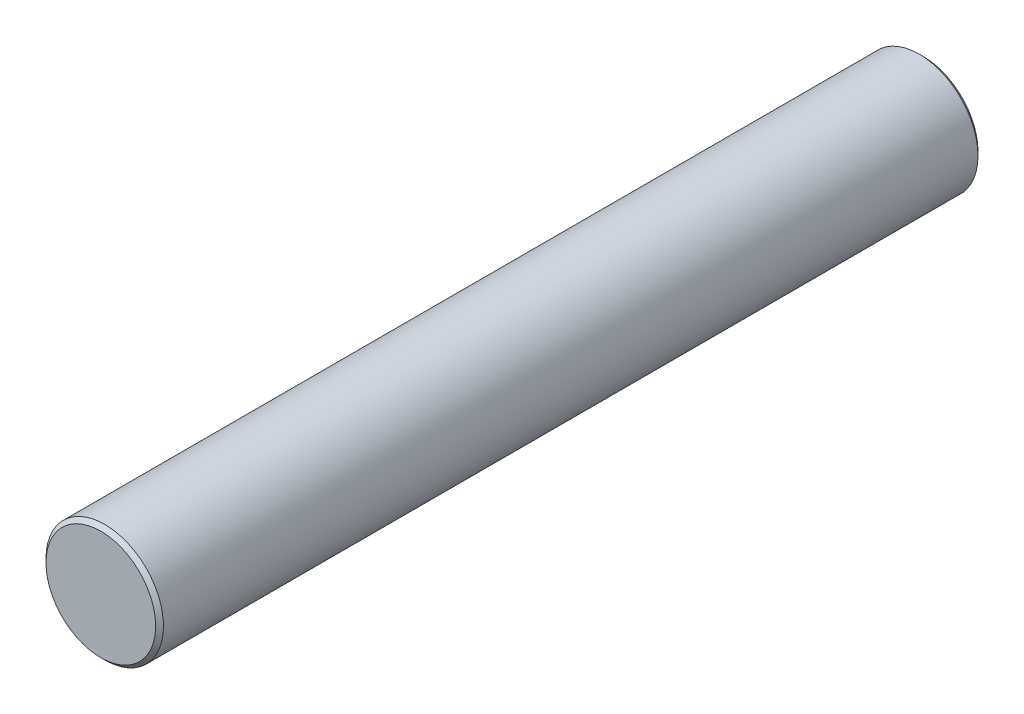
from build123d import *

# Parameters (mm, degrees)
SKETCH1_R           = 1.5
BOSS_EXTRUDE1_DEPTH = 21
CHAMFER1_SIZE       = 0.1


with BuildPart() as part:
    # Sketch1 → Boss-Extrude1 (new body)
    with BuildSketch(Plane.XY):
        with Locations(Location((0, 0, 0), (0, 0, 180))):
            Circle(SKETCH1_R)
    extrude(amount=BOSS_EXTRUDE1_DEPTH)

    # Chamfer1
    chamfer1_edges = [part.edges().sort_by_distance(p)[0] for p in [
        (1.5, 0, 0),
        (1.5, 0, 21),
    ]]
    chamfer(chamfer1_edges, length=CHAMFER1_SIZE)


solid = part.part
